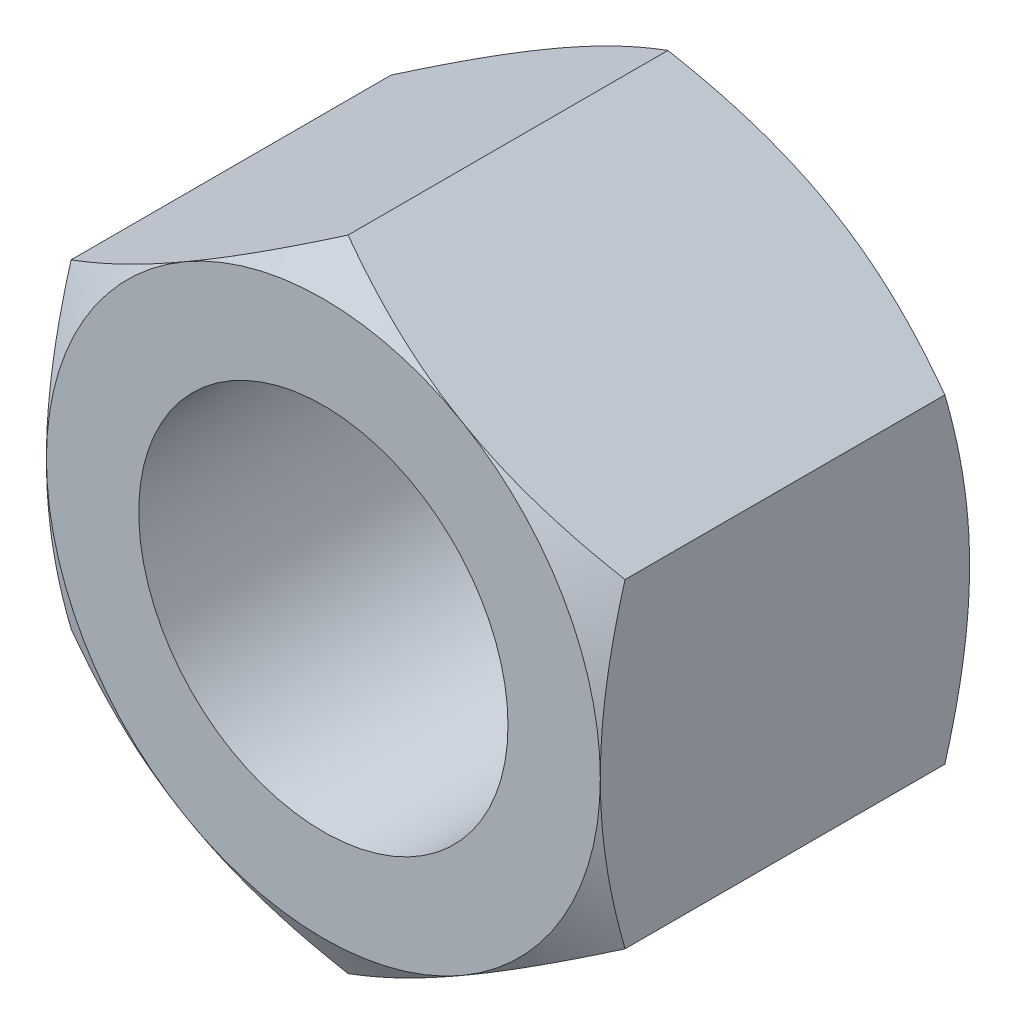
from build123d import *

# Parameters (mm, degrees)
SKETCH1_R               = 12.7
EXTRUDE1_DEPTH          = 12.7
SKETCH7_OUTSIDE_W       = 140.788
SKETCH7_OUTSIDE_H       = 146.682
SKETCH7_OUTSIDE_R       = 19.05
EXTRUDE2_DEPTH          = 25.4
EXTRUDE2_DRAFT          = -60
MIRROR1_COPY_1_SKETCH_W = 140.788
MIRROR1_COPY_1_SKETCH_H = 146.682
MIRROR1_COPY_1_SKETCH_R = 19.05
MIRROR1_COPY_1_DEPTH    = 25.4
MIRROR1_COPY_1_DRAFT    = -60


with BuildPart() as part:
    # Sketch1 → Extrude1 (new, symmetric)
    with BuildSketch(Plane.XY):
        Polygon((-19.05, 10.998522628), (-19.05, -10.998522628), (0, -21.997045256), (19.05, -10.998522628), (19.05, 10.998522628), (0, 21.997045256), align=None)
        Circle(SKETCH1_R, mode=Mode.SUBTRACT)
    extrude(amount=EXTRUDE1_DEPTH, both=True)


with BuildPart() as extrude2_tool:
    # Sketch7 outside → Extrude2 (with draft: the straight prism first)
    with BuildSketch(Plane.XY.offset(12.7)):
        Rectangle(SKETCH7_OUTSIDE_W, SKETCH7_OUTSIDE_H)
        Circle(SKETCH7_OUTSIDE_R, mode=Mode.SUBTRACT)
    extrude(amount=-EXTRUDE2_DEPTH)
    # Extrude2: the draft: its side faces are tilted about the plane it starts from
    extrude2_sides = [extrude2_tool.faces().sort_by_distance(p)[0] for p in [
        (0, -73.341, 0),
        (70.394, 0, 0),
        (0, 73.341, 0),
        (-70.394, 0, 0),
        (-19.05, 0, 0),
    ]]
    draft(extrude2_sides, Plane.XY.offset(12.7), EXTRUDE2_DRAFT)


with BuildPart() as part_1:
    add(part.part)

    # Extrude2: cut by extrude2_tool
    add(extrude2_tool.part, mode=Mode.SUBTRACT)


with BuildPart() as mirror1_copy_1_tool:
    # Mirror1 copy 1 sketch → Mirror1 copy 1 (with draft: the straight prism first)
    with BuildSketch(Plane(origin=(0, 0, -12.7), x_dir=(1, 0, 0), z_dir=(0, 0, -1))):
        Rectangle(MIRROR1_COPY_1_SKETCH_W, MIRROR1_COPY_1_SKETCH_H)
        Circle(MIRROR1_COPY_1_SKETCH_R, mode=Mode.SUBTRACT)
    extrude(amount=-MIRROR1_COPY_1_DEPTH)
    # Mirror1 copy 1: the draft: its side faces are tilted about the plane it starts from
    mirror1_copy_1_sides = [mirror1_copy_1_tool.faces().sort_by_distance(p)[0] for p in [
        (0, -73.341, 0),
        (70.394, 0, 0),
        (0, 73.341, 0),
        (-70.394, 0, 0),
        (-19.05, 0, 0),
    ]]
    draft(mirror1_copy_1_sides, Plane(origin=(0, 0, -12.7), x_dir=(1, 0, 0), z_dir=(0, 0, -1)), MIRROR1_COPY_1_DRAFT)


with BuildPart() as part_2:
    add(part_1.part)

    # Mirror1 copy 1: cut by mirror1_copy_1_tool
    add(mirror1_copy_1_tool.part, mode=Mode.SUBTRACT)


solid = part_2.part
